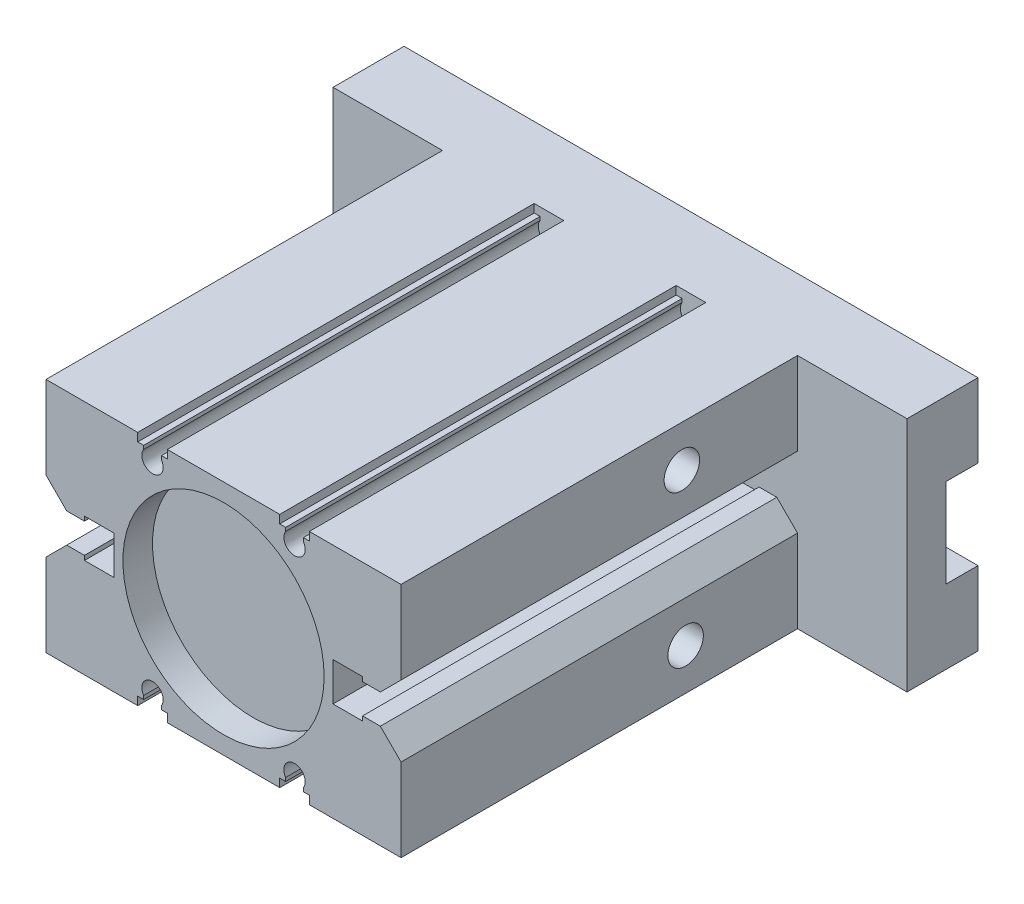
from build123d import *

# Parameters (mm, degrees)
SKETCH1_W           = 60
SKETCH1_H           = 40
BOSS_EXTRUDE1_DEPTH = 67
CUT_EXTRUDE1_DEPTH  = 77.085478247
SKETCH4_R           = 17
CUT_EXTRUDE2_DEPTH  = 5
SKETCH5_W           = 97
SKETCH5_H           = 40
BOSS_EXTRUDE2_DEPTH = 12
SKETCH7_W           = 5.367495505
SKETCH7_H           = 15
CUT_EXTRUDE3_DEPTH  = 120.574244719
SKETCH8_R           = 3
CUT_EXTRUDE4_DEPTH  = 12
SKETCH9_R           = 3
CUT_EXTRUDE5_DEPTH  = 12


with BuildPart() as part:
    # Sketch1 → Boss-Extrude1 (new body)
    with BuildSketch(Plane.XY):
        Rectangle(SKETCH1_W, SKETCH1_H)
    extrude(amount=BOSS_EXTRUDE1_DEPTH)

    # Sketch3 → Cut-Extrude1 (cut, through all)
    with BuildSketch(Plane.XY.offset(67)):
        Polygon((18.5, -3.25), (18.5, 3.25), (23.5, 3.25), (23.5, 2.5), (26.5, 2.5), (30, 6), (30, -6), (26.5, -2.5), (23.5, -2.5), (23.5, -3.25), align=None)
        Polygon((-30, 6), (-30, -6), (-26.5, -2.5), (-23.5, -2.5), (-23.5, -3.25), (-18.5, -3.25), (-18.5, 3.25), (-23.5, 3.25), (-23.5, 2.5), (-26.5, 2.5), align=None)
        with BuildLine():
            Line((9.5, -20), (9.5, -18.6))
            Line((9.5, -18.6), (10.5, -18.6))
            Line((10.5, -18.6), (10.5, -18))
            ThreePointArc((10.5, -18), (12, -15.197224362), (13.5, -18))
            Line((13.5, -18), (13.5, -18.6))
            Line((13.5, -18.6), (14.5, -18.6))
            Line((14.5, -18.6), (14.5, -20))
            Line((14.5, -20), (9.5, -20))
        make_face()
        with BuildLine():
            Line((-14.5, -20), (-9.5, -20))
            Line((-9.5, -20), (-9.5, -18.6))
            Line((-9.5, -18.6), (-10.5, -18.6))
            Line((-10.5, -18.6), (-10.5, -18))
            ThreePointArc((-10.5, -18), (-12, -15.197224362), (-13.5, -18))
            Line((-13.5, -18), (-13.5, -18.6))
            Line((-13.5, -18.6), (-14.5, -18.6))
            Line((-14.5, -18.6), (-14.5, -20))
        make_face()
        with BuildLine():
            Line((-9.5, 20), (-9.5, 18.6))
            Line((-9.5, 18.6), (-10.5, 18.6))
            Line((-10.5, 18.6), (-10.5, 18))
            ThreePointArc((-10.5, 18), (-12, 15.197224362), (-13.5, 18))
            Line((-13.5, 18), (-13.5, 18.6))
            Line((-13.5, 18.6), (-14.5, 18.6))
            Line((-14.5, 18.6), (-14.5, 20))
            Line((-14.5, 20), (-9.5, 20))
        make_face()
        with BuildLine():
            Line((14.5, 20), (9.5, 20))
            Line((9.5, 20), (9.5, 18.6))
            Line((9.5, 18.6), (10.5, 18.6))
            Line((10.5, 18.6), (10.5, 18))
            ThreePointArc((10.5, 18), (12, 15.197224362), (13.5, 18))
            Line((13.5, 18), (13.5, 18.6))
            Line((13.5, 18.6), (14.5, 18.6))
            Line((14.5, 18.6), (14.5, 20))
        make_face()
    extrude(amount=-CUT_EXTRUDE1_DEPTH, mode=Mode.SUBTRACT)

    # Sketch4 → Cut-Extrude2 (cut)
    with BuildSketch(Plane.XY.offset(67)):
        Circle(SKETCH4_R)
    extrude(amount=-CUT_EXTRUDE2_DEPTH, mode=Mode.SUBTRACT)

    # Sketch5 → Boss-Extrude2 (add)
    with BuildSketch(Plane(origin=(0, 0, 0), x_dir=(-1, 0, 0), z_dir=(0, 0, -1))):
        Rectangle(SKETCH5_W, SKETCH5_H)
    extrude(amount=BOSS_EXTRUDE2_DEPTH)

    # Sketch7 → Cut-Extrude3 (cut, through all)
    with BuildSketch(Plane.ZY.offset(48.5)):
        with Locations((-9.316252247, 0)):
            Rectangle(SKETCH7_W, SKETCH7_H)
    extrude(amount=-CUT_EXTRUDE3_DEPTH, mode=Mode.SUBTRACT)

    # Sketch8 → Cut-Extrude4 (cut)
    with BuildSketch(Plane(origin=(30, 0, 0), x_dir=(0, 0, -1), z_dir=(1, 0, 0))):
        with Locations(Location((-18.909570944, -13, 0), (0, 0, 90))):
            Circle(SKETCH8_R)
        with Locations(Location((-19.546546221, 13, 0), (0, 0, 90))):
            Circle(SKETCH8_R)
    extrude(amount=-CUT_EXTRUDE4_DEPTH, mode=Mode.SUBTRACT)

    # Sketch9 → Cut-Extrude5 (cut)
    with BuildSketch(Plane.ZY.offset(30)):
        with Locations(Location((36.764101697, -12.94298785, 0), (0, 0, 270))):
            Circle(SKETCH9_R)
        with Locations(Location((56.764101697, 13.900970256, 0), (0, 0, 270))):
            Circle(SKETCH9_R)
    extrude(amount=-CUT_EXTRUDE5_DEPTH, mode=Mode.SUBTRACT)


solid = part.part
